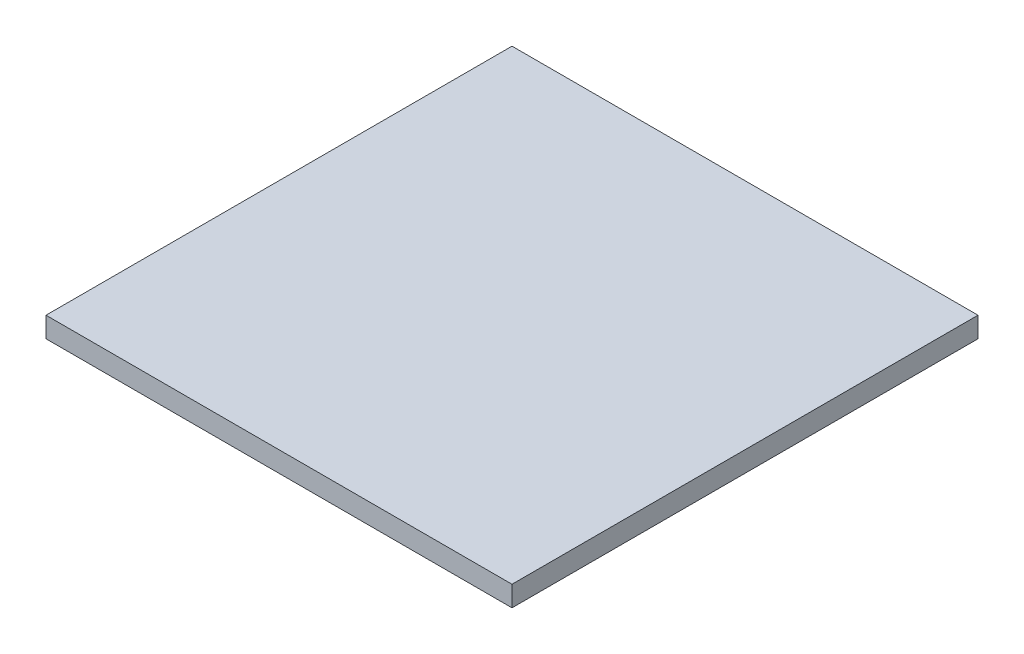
from build123d import *

# Parameters (mm, degrees)
SKETCH1_W           = 114
SKETCH1_H           = 114
BOSS_EXTRUDE1_DEPTH = 5


with BuildPart() as part:
    # Sketch1 → Boss-Extrude1 (new body)
    with BuildSketch(Plane(origin=(0, 0, 0), x_dir=(1, 0, 0), z_dir=(0, 1, 0))):
        Rectangle(SKETCH1_W, SKETCH1_H)
    extrude(amount=BOSS_EXTRUDE1_DEPTH)


solid = part.part
